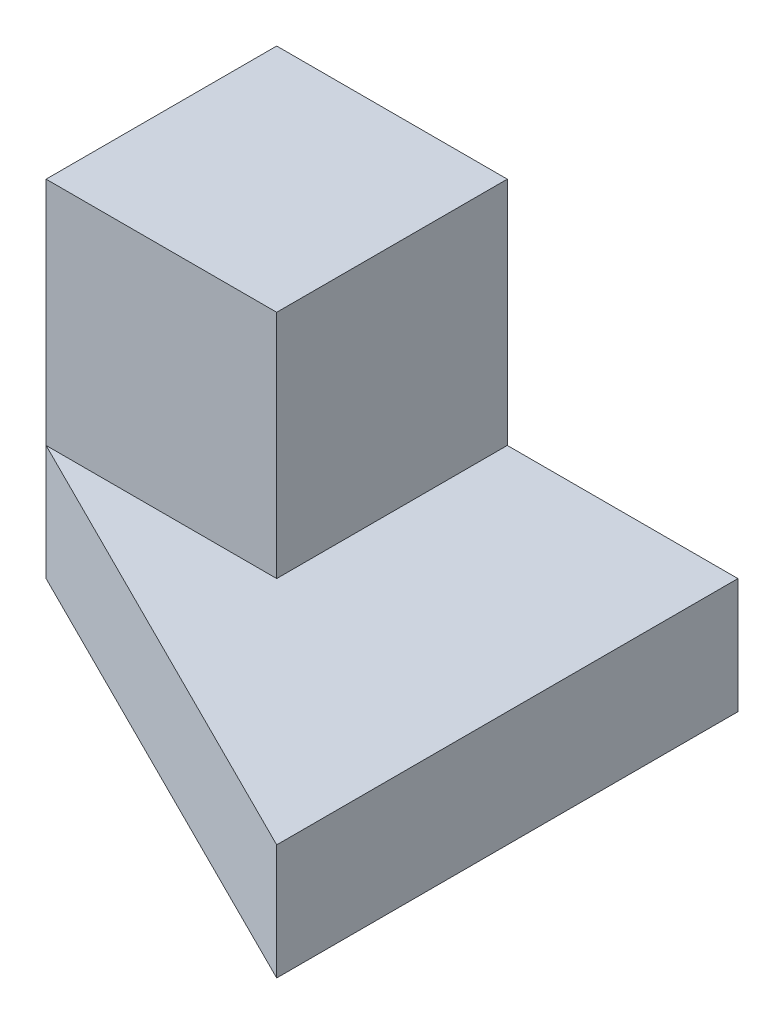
from build123d import *

# Parameters (mm, degrees)
EXTRUDE1_DEPTH = 10
SKETCH2_W      = 20
SKETCH2_H      = 20
EXTRUDE2_DEPTH = 20


with BuildPart() as part:
    # Sketch1 → Extrude1 (new body)
    with BuildSketch(Plane(origin=(0, 0, 0), x_dir=(1, 0, 0), z_dir=(0, 1, 0))):
        Polygon((40, -20), (0, 0), (0, 20), (40, 20), align=None)
    extrude(amount=EXTRUDE1_DEPTH)

    # Sketch2 → Extrude2 (add)
    with BuildSketch(Plane(origin=(0, 10, 0), x_dir=(1, 0, 0), z_dir=(0, 1, 0))):
        with Locations((10, 10)):
            Rectangle(SKETCH2_W, SKETCH2_H)
    extrude(amount=EXTRUDE2_DEPTH)


solid = part.part
